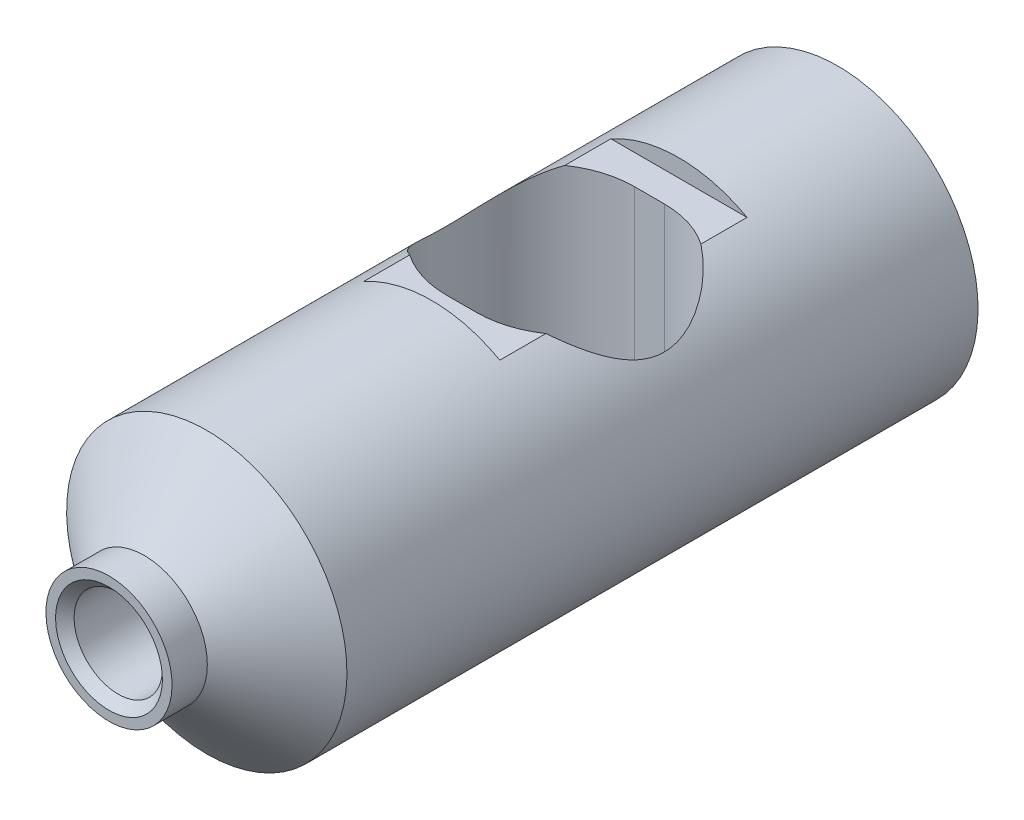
ISO-10303-21;
HEADER;
FILE_DESCRIPTION(('STEP AP214'),'2;1');
FILE_NAME('part.step','',(''),(''),'','','');
FILE_SCHEMA(('AUTOMOTIVE_DESIGN { 1 0 10303 214 1 1 1 1 }'));
ENDSEC;
DATA;
#1=APPLICATION_CONTEXT('core data for automotive mechanical design processes');
#2=APPLICATION_PROTOCOL_DEFINITION('international standard','automotive_design',2000,#1);
#3=PRODUCT_CONTEXT('',#1,'mechanical');
#4=PRODUCT('Part','Part','',(#3));
#5=PRODUCT_RELATED_PRODUCT_CATEGORY('part','',(#4));
#6=PRODUCT_DEFINITION_FORMATION('','',#4);
#7=PRODUCT_DEFINITION_CONTEXT('part definition',#1,'design');
#8=PRODUCT_DEFINITION('design','',#6,#7);
#9=PRODUCT_DEFINITION_SHAPE('','',#8);
#10=(LENGTH_UNIT() NAMED_UNIT(*) SI_UNIT(.MILLI.,.METRE.));
#11=(NAMED_UNIT(*) PLANE_ANGLE_UNIT() SI_UNIT($,.RADIAN.));
#12=(NAMED_UNIT(*) SI_UNIT($,.STERADIAN.) SOLID_ANGLE_UNIT());
#13=UNCERTAINTY_MEASURE_WITH_UNIT(LENGTH_MEASURE(1.E-05),#10,'distance_accuracy_value','');
#14=(GEOMETRIC_REPRESENTATION_CONTEXT(3) GLOBAL_UNCERTAINTY_ASSIGNED_CONTEXT((#13)) GLOBAL_UNIT_ASSIGNED_CONTEXT((#10,
#11,#12)) REPRESENTATION_CONTEXT('',''));
#15=CARTESIAN_POINT('',(0.,0.,0.));
#16=DIRECTION('',(0.,0.,1.));
#17=DIRECTION('',(1.,0.,0.));
#18=AXIS2_PLACEMENT_3D('',#15,#16,#17);
#19=CARTESIAN_POINT('',(0.,0.,-15.8750000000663));
#20=DIRECTION('',(0.,0.,1.));
#21=DIRECTION('',(0.,1.,0.));
#22=AXIS2_PLACEMENT_3D('',#19,#20,#21);
#23=CONICAL_SURFACE('',#22,2.49999999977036,1.0297442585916);
#24=CARTESIAN_POINT('',(0.,-5.6843418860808E-11,-17.3771515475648));
#25=VERTEX_POINT('',#24);
#26=VERTEX_LOOP('',#25);
#27=FACE_BOUND('',#26,.T.);
#28=CARTESIAN_POINT('',(0.,0.,-15.875));
#29=DIRECTION('',(0.,0.,1.));
#30=DIRECTION('',(0.,1.,0.));
#31=AXIS2_PLACEMENT_3D('',#28,#29,#30);
#32=CIRCLE('',#31,2.5);
#33=CARTESIAN_POINT('',(0.,2.5,-15.875));
#34=VERTEX_POINT('',#33);
#35=EDGE_CURVE('E91',#34,#34,#32,.T.);
#36=ORIENTED_EDGE('',*,*,#35,.T.);
#37=EDGE_LOOP('',(#36));
#38=FACE_BOUND('',#37,.T.);
#39=ADVANCED_FACE('F14',(#27,#38),#23,.F.);
#40=CARTESIAN_POINT('',(0.,0.,0.));
#41=DIRECTION('',(0.,0.,1.));
#42=DIRECTION('',(0.,1.,0.));
#43=AXIS2_PLACEMENT_3D('',#40,#41,#42);
#44=CYLINDRICAL_SURFACE('',#43,2.5);
#45=CARTESIAN_POINT('',(0.,0.,-0.524999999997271));
#46=DIRECTION('',(0.,0.,1.));
#47=DIRECTION('',(0.,1.,0.));
#48=AXIS2_PLACEMENT_3D('',#45,#46,#47);
#49=CIRCLE('',#48,2.50000000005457);
#50=CARTESIAN_POINT('',(0.,2.50000000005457,-0.524999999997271));
#51=VERTEX_POINT('',#50);
#52=EDGE_CURVE('E93',#51,#51,#49,.T.);
#53=ORIENTED_EDGE('',*,*,#52,.T.);
#54=EDGE_LOOP('',(#53));
#55=FACE_BOUND('',#54,.T.);
#56=ORIENTED_EDGE('',*,*,#35,.F.);
#57=EDGE_LOOP('',(#56));
#58=FACE_BOUND('',#57,.T.);
#59=ADVANCED_FACE('F88',(#55,#58),#44,.F.);
#60=CARTESIAN_POINT('',(0.,0.,-7.22130688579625E-11));
#61=DIRECTION('',(0.,0.,1.));
#62=DIRECTION('',(0.,1.,0.));
#63=AXIS2_PLACEMENT_3D('',#60,#61,#62);
#64=CONICAL_SURFACE('',#63,3.02499999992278,0.785398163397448);
#65=CARTESIAN_POINT('',(0.,0.,-1.53696499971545E-11));
#66=DIRECTION('',(0.,0.,1.));
#67=DIRECTION('',(0.,1.,0.));
#68=AXIS2_PLACEMENT_3D('',#65,#66,#67);
#69=CIRCLE('',#68,3.02499999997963);
#70=CARTESIAN_POINT('',(0.,3.02499999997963,-1.53696499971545E-11));
#71=VERTEX_POINT('',#70);
#72=EDGE_CURVE('E17',#71,#71,#69,.F.);
#73=ORIENTED_EDGE('',*,*,#72,.F.);
#74=EDGE_LOOP('',(#73));
#75=FACE_BOUND('',#74,.T.);
#76=ORIENTED_EDGE('',*,*,#52,.F.);
#77=EDGE_LOOP('',(#76));
#78=FACE_BOUND('',#77,.T.);
#79=ADVANCED_FACE('F163',(#75,#78),#64,.F.);
#80=CARTESIAN_POINT('',(0.,0.,0.));
#81=DIRECTION('',(0.,0.,1.));
#82=DIRECTION('',(0.,1.,0.));
#83=AXIS2_PLACEMENT_3D('',#80,#81,#82);
#84=PLANE('',#83);
#85=CARTESIAN_POINT('',(0.,0.,0.));
#86=DIRECTION('',(0.,0.,1.));
#87=DIRECTION('',(0.,1.,0.));
#88=AXIS2_PLACEMENT_3D('',#85,#86,#87);
#89=CIRCLE('',#88,3.5687);
#90=CARTESIAN_POINT('',(0.,3.5687,0.));
#91=VERTEX_POINT('',#90);
#92=EDGE_CURVE('E334',#91,#91,#89,.F.);
#93=ORIENTED_EDGE('',*,*,#92,.F.);
#94=EDGE_LOOP('',(#93));
#95=FACE_BOUND('',#94,.T.);
#96=ORIENTED_EDGE('',*,*,#72,.T.);
#97=EDGE_LOOP('',(#96));
#98=FACE_BOUND('',#97,.T.);
#99=ADVANCED_FACE('F159',(#95,#98),#84,.T.);
#100=CARTESIAN_POINT('',(0.,0.,0.));
#101=DIRECTION('',(0.,0.,1.));
#102=DIRECTION('',(0.,1.,0.));
#103=AXIS2_PLACEMENT_3D('',#100,#101,#102);
#104=CYLINDRICAL_SURFACE('',#103,3.5687);
#105=ORIENTED_EDGE('',*,*,#92,.T.);
#106=EDGE_LOOP('',(#105));
#107=FACE_BOUND('',#106,.T.);
#108=CARTESIAN_POINT('',(0.,0.,-2.00000000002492));
#109=DIRECTION('',(0.,0.,-1.));
#110=DIRECTION('',(0.,-1.,0.));
#111=AXIS2_PLACEMENT_3D('',#108,#109,#110);
#112=CIRCLE('',#111,3.56870000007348);
#113=CARTESIAN_POINT('',(0.,-3.56870000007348,-2.00000000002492));
#114=VERTEX_POINT('',#113);
#115=EDGE_CURVE('E335',#114,#114,#112,.T.);
#116=ORIENTED_EDGE('',*,*,#115,.F.);
#117=EDGE_LOOP('',(#116));
#118=FACE_BOUND('',#117,.T.);
#119=ADVANCED_FACE('F156',(#107,#118),#104,.T.);
#120=CARTESIAN_POINT('',(0.850347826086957,-2.199999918,-25.274999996));
#121=DIRECTION('',(0.,-1.,0.));
#122=DIRECTION('',(1.,0.,0.));
#123=AXIS2_PLACEMENT_3D('',#120,#121,#122);
#124=PLANE('',#123);
#125=DIRECTION('',(-1.,0.,0.));
#126=VECTOR('',#125,1.);
#127=CARTESIAN_POINT('',(0.850347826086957,-2.199999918,-30.596299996));
#128=LINE('',#127,#126);
#129=CARTESIAN_POINT('',(0.850347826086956,-2.199999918,-30.596299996));
#130=VERTEX_POINT('',#129);
#131=CARTESIAN_POINT('',(-0.850347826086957,-2.199999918,-30.596299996));
#132=VERTEX_POINT('',#131);
#133=EDGE_CURVE('E328',#130,#132,#128,.T.);
#134=ORIENTED_EDGE('',*,*,#133,.T.);
#135=CARTESIAN_POINT('',(-0.850347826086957,-2.199999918,-25.274999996));
#136=DIRECTION('',(0.,-1.,0.));
#137=DIRECTION('',(1.,0.,0.));
#138=AXIS2_PLACEMENT_3D('',#135,#136,#137);
#139=CIRCLE('',#138,5.3213);
#140=CARTESIAN_POINT('',(-0.850347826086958,-2.199999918,-19.953699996));
#141=VERTEX_POINT('',#140);
#142=EDGE_CURVE('E332',#132,#141,#139,.F.);
#143=ORIENTED_EDGE('',*,*,#142,.T.);
#144=DIRECTION('',(-1.,0.,0.));
#145=VECTOR('',#144,1.);
#146=CARTESIAN_POINT('',(0.850347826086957,-2.199999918,-19.953699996));
#147=LINE('',#146,#145);
#148=CARTESIAN_POINT('',(0.850347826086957,-2.199999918,-19.953699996));
#149=VERTEX_POINT('',#148);
#150=EDGE_CURVE('E79',#141,#149,#147,.F.);
#151=ORIENTED_EDGE('',*,*,#150,.T.);
#152=CARTESIAN_POINT('',(0.850347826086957,-2.199999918,-25.274999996));
#153=DIRECTION('',(0.,-1.,0.));
#154=DIRECTION('',(1.,0.,0.));
#155=AXIS2_PLACEMENT_3D('',#152,#153,#154);
#156=CIRCLE('',#155,5.3213);
#157=EDGE_CURVE('E82',#149,#130,#156,.F.);
#158=ORIENTED_EDGE('',*,*,#157,.T.);
#159=EDGE_LOOP('',(#134,#143,#151,#158));
#160=FACE_BOUND('',#159,.T.);
#161=ADVANCED_FACE('F152',(#160),#124,.F.);
#162=CARTESIAN_POINT('',(0.850347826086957,7.9375,-19.953699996));
#163=DIRECTION('',(0.,0.,1.));
#164=DIRECTION('',(0.,1.,0.));
#165=AXIS2_PLACEMENT_3D('',#162,#163,#164);
#166=PLANE('',#165);
#167=DIRECTION('',(1.,0.,0.));
#168=VECTOR('',#167,1.);
#169=CARTESIAN_POINT('',(7.9375,6.9375,-19.953699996));
#170=LINE('',#169,#168);
#171=CARTESIAN_POINT('',(-0.850347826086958,6.9375,-19.953699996));
#172=VERTEX_POINT('',#171);
#173=CARTESIAN_POINT('',(0.850347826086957,6.9375,-19.953699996));
#174=VERTEX_POINT('',#173);
#175=EDGE_CURVE('E337',#172,#174,#170,.T.);
#176=ORIENTED_EDGE('',*,*,#175,.T.);
#177=DIRECTION('',(0.,-1.,0.));
#178=VECTOR('',#177,1.);
#179=CARTESIAN_POINT('',(0.850347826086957,7.9375,-19.953699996));
#180=LINE('',#179,#178);
#181=EDGE_CURVE('E325',#174,#149,#180,.T.);
#182=ORIENTED_EDGE('',*,*,#181,.T.);
#183=ORIENTED_EDGE('',*,*,#150,.F.);
#184=DIRECTION('',(0.,-1.,0.));
#185=VECTOR('',#184,1.);
#186=CARTESIAN_POINT('',(-0.850347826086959,7.9375,-19.953699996));
#187=LINE('',#186,#185);
#188=EDGE_CURVE('E330',#141,#172,#187,.F.);
#189=ORIENTED_EDGE('',*,*,#188,.T.);
#190=EDGE_LOOP('',(#176,#182,#183,#189));
#191=FACE_BOUND('',#190,.T.);
#192=ADVANCED_FACE('F148',(#191),#166,.F.);
#193=CARTESIAN_POINT('',(0.850347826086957,7.9375,-30.596299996));
#194=DIRECTION('',(0.,0.,-1.));
#195=DIRECTION('',(0.,-1.,0.));
#196=AXIS2_PLACEMENT_3D('',#193,#194,#195);
#197=PLANE('',#196);
#198=DIRECTION('',(-1.,0.,0.));
#199=VECTOR('',#198,1.);
#200=CARTESIAN_POINT('',(0.850347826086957,6.9375,-30.596299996));
#201=LINE('',#200,#199);
#202=CARTESIAN_POINT('',(-0.850347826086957,6.9375,-30.596299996));
#203=VERTEX_POINT('',#202);
#204=CARTESIAN_POINT('',(0.850347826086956,6.9375,-30.596299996));
#205=VERTEX_POINT('',#204);
#206=EDGE_CURVE('E326',#203,#205,#201,.F.);
#207=ORIENTED_EDGE('',*,*,#206,.F.);
#208=DIRECTION('',(0.,-1.,0.));
#209=VECTOR('',#208,1.);
#210=CARTESIAN_POINT('',(-0.850347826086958,7.9375,-30.596299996));
#211=LINE('',#210,#209);
#212=EDGE_CURVE('E317',#203,#132,#211,.T.);
#213=ORIENTED_EDGE('',*,*,#212,.T.);
#214=ORIENTED_EDGE('',*,*,#133,.F.);
#215=DIRECTION('',(0.,-1.,0.));
#216=VECTOR('',#215,1.);
#217=CARTESIAN_POINT('',(0.850347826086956,7.9375,-30.596299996));
#218=LINE('',#217,#216);
#219=EDGE_CURVE('E322',#130,#205,#218,.F.);
#220=ORIENTED_EDGE('',*,*,#219,.T.);
#221=EDGE_LOOP('',(#207,#213,#214,#220));
#222=FACE_BOUND('',#221,.T.);
#223=ADVANCED_FACE('F143',(#222),#197,.F.);
#224=CARTESIAN_POINT('',(0.850347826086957,7.9375,-25.274999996));
#225=DIRECTION('',(0.,-1.,0.));
#226=DIRECTION('',(1.,0.,0.));
#227=AXIS2_PLACEMENT_3D('',#224,#225,#226);
#228=CYLINDRICAL_SURFACE('',#227,5.3213);
#229=CARTESIAN_POINT('',(3.85681215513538,6.9375,-29.6656042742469));
#230=CARTESIAN_POINT('',(3.99388811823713,6.86131547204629,-29.5717055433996));
#231=CARTESIAN_POINT('',(4.12563560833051,6.7827347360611,-29.4720963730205));
#232=CARTESIAN_POINT('',(4.37823980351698,6.62247798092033,-29.2621372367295));
#233=CARTESIAN_POINT('',(4.49909703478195,6.54080211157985,-29.1517877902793));
#234=CARTESIAN_POINT('',(4.73067532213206,6.37534781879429,-28.9200431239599));
#235=CARTESIAN_POINT('',(4.84130200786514,6.29155745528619,-28.7985623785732));
#236=CARTESIAN_POINT('',(5.05101717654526,6.12446631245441,-28.5457174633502));
#237=CARTESIAN_POINT('',(5.15010711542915,6.04116547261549,-28.4143545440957));
#238=CARTESIAN_POINT('',(5.31798357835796,5.89346053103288,-28.1687859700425));
#239=CARTESIAN_POINT('',(5.38889003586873,5.82857336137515,-28.0563151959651));
#240=CARTESIAN_POINT('',(5.52276878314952,5.70187879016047,-27.8250159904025));
#241=CARTESIAN_POINT('',(5.58573885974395,5.64007225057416,-27.706185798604));
#242=CARTESIAN_POINT('',(5.70310902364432,5.52135859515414,-27.4625014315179));
#243=CARTESIAN_POINT('',(5.75753435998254,5.46443727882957,-27.3376664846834));
#244=CARTESIAN_POINT('',(5.85742598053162,5.35722254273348,-27.081737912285));
#245=CARTESIAN_POINT('',(5.90289246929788,5.30692897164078,-26.9506444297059));
#246=CARTESIAN_POINT('',(6.00115110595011,5.19593033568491,-26.6259059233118));
#247=CARTESIAN_POINT('',(6.04901559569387,5.13970787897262,-26.429089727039));
#248=CARTESIAN_POINT('',(6.10396659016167,5.07408120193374,-26.1271718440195));
#249=CARTESIAN_POINT('',(6.11946808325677,5.05533392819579,-26.0255332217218));
#250=CARTESIAN_POINT('',(6.14461588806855,5.02473895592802,-25.8205231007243));
#251=CARTESIAN_POINT('',(6.15426586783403,5.01288693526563,-25.7171527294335));
#252=CARTESIAN_POINT('',(6.16446272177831,5.00033337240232,-25.5571247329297));
#253=CARTESIAN_POINT('',(6.16715478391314,4.99701083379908,-25.5007904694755));
#254=CARTESIAN_POINT('',(6.17074788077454,4.9925728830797,-25.3879745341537));
#255=CARTESIAN_POINT('',(6.17164876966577,4.99145765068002,-25.3314928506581));
#256=CARTESIAN_POINT('',(6.17164581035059,4.99146389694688,-25.1543161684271));
#257=CARTESIAN_POINT('',(6.16752815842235,4.99656675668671,-25.0335813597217));
#258=CARTESIAN_POINT('',(6.15118171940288,5.01667507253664,-24.7934326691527));
#259=CARTESIAN_POINT('',(6.13894586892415,5.03168915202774,-24.6740200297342));
#260=CARTESIAN_POINT('',(6.10666567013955,5.07081662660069,-24.4373403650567));
#261=CARTESIAN_POINT('',(6.08659336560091,5.09496258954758,-24.3200826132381));
#262=CARTESIAN_POINT('',(6.03912597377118,5.15113693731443,-24.0889325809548));
#263=CARTESIAN_POINT('',(6.01172539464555,5.18317123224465,-23.9750428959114));
#264=CARTESIAN_POINT('',(5.94379686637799,5.26102346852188,-23.7281982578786));
#265=CARTESIAN_POINT('',(5.90172826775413,5.30832116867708,-23.5961365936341));
#266=CARTESIAN_POINT('',(5.80854579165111,5.41012584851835,-23.3381650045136));
#267=CARTESIAN_POINT('',(5.75743030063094,5.46463411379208,-23.2122561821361));
#268=CARTESIAN_POINT('',(5.64666822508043,5.57901391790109,-22.9663701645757));
#269=CARTESIAN_POINT('',(5.58700053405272,5.63889858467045,-22.8464086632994));
#270=CARTESIAN_POINT('',(5.45969756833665,5.76224548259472,-22.6127001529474));
#271=CARTESIAN_POINT('',(5.3920600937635,5.82570869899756,-22.498954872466));
#272=CARTESIAN_POINT('',(5.22442189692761,5.97713140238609,-22.2393524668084));
#273=CARTESIAN_POINT('',(5.12132014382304,6.06596989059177,-22.0959997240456));
#274=CARTESIAN_POINT('',(4.90179417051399,6.24470858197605,-21.8205786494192));
#275=CARTESIAN_POINT('',(4.78536680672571,6.33460903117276,-21.6885129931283));
#276=CARTESIAN_POINT('',(4.54072611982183,6.51216560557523,-21.4373201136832));
#277=CARTESIAN_POINT('',(4.4126419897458,6.59983517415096,-21.3180769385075));
#278=CARTESIAN_POINT('',(4.14400879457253,6.7717523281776,-21.091848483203));
#279=CARTESIAN_POINT('',(4.00346109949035,6.85600028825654,-20.9848618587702));
#280=CARTESIAN_POINT('',(3.8568121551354,6.9375,-20.8843957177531));
#281=B_SPLINE_CURVE_WITH_KNOTS('',3,(#229,#230,#231,#232,#233,#234,#235,#236,#237,#238,#239,
#240,#241,#242,#243,#244,#245,#246,#247,#248,#249,#250,#251,#252,#253,#254,#255,#256,#257,#258,
#259,#260,#261,#262,#263,#264,#265,#266,#267,#268,#269,#270,#271,#272,#273,#274,#275,#276,#277,
#278,#279,#280),.UNSPECIFIED.,.F.,.F.,(4,2,2,2,2,2,2,2,2,2,2,2,2,2,2,2,2,2,2,2,2,2,2,2,2,4),(0.,
0.548086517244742,1.09614653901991,1.64884172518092,2.20146708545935,2.64495744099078,
3.08857119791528,3.53084838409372,3.97311547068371,4.60090740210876,4.9141102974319,
5.22711665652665,5.39654189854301,5.56598093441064,5.92794797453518,6.29023036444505,
6.65381716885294,7.01767721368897,7.45633162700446,7.89506435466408,8.33489912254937,
8.77485558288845,9.36701762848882,9.95931965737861,10.5457116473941,11.1320392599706),.UNSPECIFIED.);
#282=CARTESIAN_POINT('',(3.85681215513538,6.9375,-29.6656042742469));
#283=VERTEX_POINT('',#282);
#284=CARTESIAN_POINT('',(3.85681215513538,6.9375,-20.8843957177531));
#285=VERTEX_POINT('',#284);
#286=EDGE_CURVE('E125',#283,#285,#281,.T.);
#287=ORIENTED_EDGE('',*,*,#286,.F.);
#288=CARTESIAN_POINT('',(0.850347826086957,6.9375,-25.274999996));
#289=DIRECTION('',(0.,-1.,0.));
#290=DIRECTION('',(1.,0.,0.));
#291=AXIS2_PLACEMENT_3D('',#288,#289,#290);
#292=CIRCLE('',#291,5.3213);
#293=EDGE_CURVE('E320',#283,#205,#292,.F.);
#294=ORIENTED_EDGE('',*,*,#293,.T.);
#295=ORIENTED_EDGE('',*,*,#219,.F.);
#296=ORIENTED_EDGE('',*,*,#157,.F.);
#297=ORIENTED_EDGE('',*,*,#181,.F.);
#298=CARTESIAN_POINT('',(0.850347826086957,6.9375,-25.274999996));
#299=DIRECTION('',(0.,-1.,0.));
#300=DIRECTION('',(1.,0.,0.));
#301=AXIS2_PLACEMENT_3D('',#298,#299,#300);
#302=CIRCLE('',#301,5.3213);
#303=EDGE_CURVE('E340',#174,#285,#302,.F.);
#304=ORIENTED_EDGE('',*,*,#303,.T.);
#305=EDGE_LOOP('',(#287,#294,#295,#296,#297,#304));
#306=FACE_BOUND('',#305,.T.);
#307=ADVANCED_FACE('F137',(#306),#228,.F.);
#308=CARTESIAN_POINT('',(0.,0.,-5.53778448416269));
#309=DIRECTION('',(0.,0.,-1.));
#310=DIRECTION('',(0.,-1.,0.));
#311=AXIS2_PLACEMENT_3D('',#308,#309,#310);
#312=CONICAL_SURFACE('',#311,7.93749999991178,0.890117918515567);
#313=CARTESIAN_POINT('',(0.,0.,-5.53778448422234));
#314=DIRECTION('',(0.,0.,-1.));
#315=DIRECTION('',(0.,-1.,0.));
#316=AXIS2_PLACEMENT_3D('',#313,#314,#315);
#317=CIRCLE('',#316,7.9375);
#318=CARTESIAN_POINT('',(0.,-7.9375,-5.53778448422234));
#319=VERTEX_POINT('',#318);
#320=EDGE_CURVE('E308',#319,#319,#317,.T.);
#321=ORIENTED_EDGE('',*,*,#320,.F.);
#322=EDGE_LOOP('',(#321));
#323=FACE_BOUND('',#322,.T.);
#324=ORIENTED_EDGE('',*,*,#115,.T.);
#325=EDGE_LOOP('',(#324));
#326=FACE_BOUND('',#325,.T.);
#327=ADVANCED_FACE('F142',(#323,#326),#312,.T.);
#328=CARTESIAN_POINT('',(7.9375,7.9375,-18.274999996));
#329=DIRECTION('',(0.,0.,1.));
#330=DIRECTION('',(0.,1.,0.));
#331=AXIS2_PLACEMENT_3D('',#328,#329,#330);
#332=PLANE('',#331);
#333=DIRECTION('',(1.,0.,0.));
#334=VECTOR('',#333,1.);
#335=CARTESIAN_POINT('',(7.9375,6.9375,-18.274999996));
#336=LINE('',#335,#334);
#337=CARTESIAN_POINT('',(3.85681215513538,6.9375,-18.274999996));
#338=VERTEX_POINT('',#337);
#339=CARTESIAN_POINT('',(-3.85681215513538,6.9375,-18.274999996));
#340=VERTEX_POINT('',#339);
#341=EDGE_CURVE('E315',#338,#340,#336,.F.);
#342=ORIENTED_EDGE('',*,*,#341,.T.);
#343=CARTESIAN_POINT('',(0.,0.,-18.274999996));
#344=DIRECTION('',(0.,0.,-1.));
#345=DIRECTION('',(0.,-1.,0.));
#346=AXIS2_PLACEMENT_3D('',#343,#344,#345);
#347=CIRCLE('',#346,7.9375);
#348=EDGE_CURVE('E111',#338,#340,#347,.F.);
#349=ORIENTED_EDGE('',*,*,#348,.F.);
#350=EDGE_LOOP('',(#342,#349));
#351=FACE_BOUND('',#350,.T.);
#352=ADVANCED_FACE('F212',(#351),#332,.F.);
#353=CARTESIAN_POINT('',(7.9375,6.9375,-32.274999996));
#354=DIRECTION('',(0.,-1.,0.));
#355=DIRECTION('',(1.,0.,0.));
#356=AXIS2_PLACEMENT_3D('',#353,#354,#355);
#357=PLANE('',#356);
#358=DIRECTION('',(0.,0.,-1.));
#359=VECTOR('',#358,1.);
#360=CARTESIAN_POINT('',(3.85681215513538,6.9375,0.));
#361=LINE('',#360,#359);
#362=EDGE_CURVE('E133',#285,#338,#361,.F.);
#363=ORIENTED_EDGE('',*,*,#362,.F.);
#364=ORIENTED_EDGE('',*,*,#303,.F.);
#365=ORIENTED_EDGE('',*,*,#175,.F.);
#366=CARTESIAN_POINT('',(-0.850347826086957,6.9375,-25.274999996));
#367=DIRECTION('',(0.,-1.,0.));
#368=DIRECTION('',(1.,0.,0.));
#369=AXIS2_PLACEMENT_3D('',#366,#367,#368);
#370=CIRCLE('',#369,5.3213);
#371=CARTESIAN_POINT('',(-3.85681215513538,6.9375,-20.8843957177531));
#372=VERTEX_POINT('',#371);
#373=EDGE_CURVE('E321',#172,#372,#370,.T.);
#374=ORIENTED_EDGE('',*,*,#373,.T.);
#375=DIRECTION('',(0.,0.,-1.));
#376=VECTOR('',#375,1.);
#377=CARTESIAN_POINT('',(-3.85681215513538,6.9375,0.));
#378=LINE('',#377,#376);
#379=EDGE_CURVE('E110',#340,#372,#378,.T.);
#380=ORIENTED_EDGE('',*,*,#379,.F.);
#381=ORIENTED_EDGE('',*,*,#341,.F.);
#382=EDGE_LOOP('',(#363,#364,#365,#374,#380,#381));
#383=FACE_BOUND('',#382,.T.);
#384=ADVANCED_FACE('F219',(#383),#357,.F.);
#385=CARTESIAN_POINT('',(-0.850347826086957,7.9375,-25.274999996));
#386=DIRECTION('',(0.,-1.,0.));
#387=DIRECTION('',(1.,0.,0.));
#388=AXIS2_PLACEMENT_3D('',#385,#386,#387);
#389=CYLINDRICAL_SURFACE('',#388,5.3213);
#390=CARTESIAN_POINT('',(-0.850347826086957,6.9375,-25.274999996));
#391=DIRECTION('',(0.,-1.,0.));
#392=DIRECTION('',(1.,0.,0.));
#393=AXIS2_PLACEMENT_3D('',#390,#391,#392);
#394=CIRCLE('',#393,5.3213);
#395=CARTESIAN_POINT('',(-3.85681215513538,6.9375,-29.6656042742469));
#396=VERTEX_POINT('',#395);
#397=EDGE_CURVE('E135',#203,#396,#394,.F.);
#398=ORIENTED_EDGE('',*,*,#397,.T.);
#399=CARTESIAN_POINT('',(-3.85681215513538,6.9375,-20.8843957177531));
#400=CARTESIAN_POINT('',(-3.99388317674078,6.8613182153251,-20.9782910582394));
#401=CARTESIAN_POINT('',(-4.12562610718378,6.78274040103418,-21.0778964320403));
#402=CARTESIAN_POINT('',(-4.37822175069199,6.62248979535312,-21.2878470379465));
#403=CARTESIAN_POINT('',(-4.49907500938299,6.5408171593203,-21.3981917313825));
#404=CARTESIAN_POINT('',(-4.73065469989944,6.37536324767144,-21.6299346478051));
#405=CARTESIAN_POINT('',(-4.84128594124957,6.29156992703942,-21.751419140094));
#406=CARTESIAN_POINT('',(-5.05100967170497,6.12447262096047,-22.0042725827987));
#407=CARTESIAN_POINT('',(-5.15010358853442,6.04116857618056,-22.1356403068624));
#408=CARTESIAN_POINT('',(-5.3179952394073,5.89345027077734,-22.3812310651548));
#409=CARTESIAN_POINT('',(-5.38891216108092,5.82855311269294,-22.4937198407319));
#410=CARTESIAN_POINT('',(-5.52281176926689,5.70183742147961,-22.7250614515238));
#411=CARTESIAN_POINT('',(-5.58579195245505,5.64001986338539,-22.8439162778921));
#412=CARTESIAN_POINT('',(-5.70315779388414,5.52130795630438,-23.0876079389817));
#413=CARTESIAN_POINT('',(-5.75757170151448,5.46439771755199,-23.2124232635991));
#414=CARTESIAN_POINT('',(-5.85744275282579,5.35720402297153,-23.4683109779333));
#415=CARTESIAN_POINT('',(-5.90290025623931,5.30692030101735,-23.5993831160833));
#416=CARTESIAN_POINT('',(-6.00037201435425,5.1968102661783,-23.9215166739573));
#417=CARTESIAN_POINT('',(-6.04771874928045,5.14122983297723,-24.1155766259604));
#418=CARTESIAN_POINT('',(-6.10239908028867,5.07596573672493,-24.4133724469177));
#419=CARTESIAN_POINT('',(-6.11789979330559,5.05723245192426,-24.5137162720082));
#420=CARTESIAN_POINT('',(-6.14319908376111,5.02647119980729,-24.7161252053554));
#421=CARTESIAN_POINT('',(-6.15300011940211,5.01444034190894,-24.818189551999));
#422=CARTESIAN_POINT('',(-6.16673337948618,4.99754205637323,-25.0240177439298));
#423=CARTESIAN_POINT('',(-6.17062470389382,4.99272455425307,-25.1277884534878));
#424=CARTESIAN_POINT('',(-6.1723173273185,4.99063194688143,-25.3354545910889));
#425=CARTESIAN_POINT('',(-6.17011879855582,4.99335662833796,-25.4393500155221));
#426=CARTESIAN_POINT('',(-6.15968208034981,5.00622512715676,-25.6464268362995));
#427=CARTESIAN_POINT('',(-6.15144053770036,5.01637306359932,-25.7496078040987));
#428=CARTESIAN_POINT('',(-6.12909977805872,5.04364455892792,-25.9544379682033));
#429=CARTESIAN_POINT('',(-6.11499750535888,5.06077175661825,-26.0560863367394));
#430=CARTESIAN_POINT('',(-6.07833474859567,5.1047726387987,-26.274310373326));
#431=CARTESIAN_POINT('',(-6.0547424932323,5.13280978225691,-26.3904783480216));
#432=CARTESIAN_POINT('',(-6.00043459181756,5.1961945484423,-26.6191250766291));
#433=CARTESIAN_POINT('',(-5.96971377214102,5.23154747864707,-26.7316010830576));
#434=CARTESIAN_POINT('',(-5.86749512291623,5.34666977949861,-27.0633139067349));
#435=CARTESIAN_POINT('',(-5.78600937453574,5.43541584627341,-27.2764457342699));
#436=CARTESIAN_POINT('',(-5.62599434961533,5.600124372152,-27.6277865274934));
#437=CARTESIAN_POINT('',(-5.55301957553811,5.67271388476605,-27.7702707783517));
#438=CARTESIAN_POINT('',(-5.39574667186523,5.8225087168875,-28.0464288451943));
#439=CARTESIAN_POINT('',(-5.3114429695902,5.89971629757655,-28.1800982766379));
#440=CARTESIAN_POINT('',(-5.13211332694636,6.05635985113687,-28.4384536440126));
#441=CARTESIAN_POINT('',(-5.037094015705,6.13579442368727,-28.5631450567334));
#442=CARTESIAN_POINT('',(-4.83663679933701,6.2950166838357,-28.8034839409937));
#443=CARTESIAN_POINT('',(-4.73120364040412,6.37480419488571,-28.9191354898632));
#444=CARTESIAN_POINT('',(-4.50434837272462,6.53721545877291,-29.1469101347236));
#445=CARTESIAN_POINT('',(-4.38238086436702,6.61977196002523,-29.2585399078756));
#446=CARTESIAN_POINT('',(-4.12766342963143,6.781525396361,-29.4705618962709));
#447=CARTESIAN_POINT('',(-3.99494218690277,6.86073046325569,-29.5709824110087));
#448=CARTESIAN_POINT('',(-3.85681215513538,6.9375,-29.6656042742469));
#449=B_SPLINE_CURVE_WITH_KNOTS('',3,(#399,#400,#401,#402,#403,#404,#405,#406,#407,#408,#409,
#410,#411,#412,#413,#414,#415,#416,#417,#418,#419,#420,#421,#422,#423,#424,#425,#426,#427,#428,
#429,#430,#431,#432,#433,#434,#435,#436,#437,#438,#439,#440,#441,#442,#443,#444,#445,#446,#447,
#448),.UNSPECIFIED.,.F.,.F.,(4,2,2,2,2,2,2,2,2,2,2,2,2,2,2,2,2,2,2,2,2,2,2,2,4),(0.,
0.548066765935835,1.09610605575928,1.6488208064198,2.2014670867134,2.64502662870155,
3.08872572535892,3.53092949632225,3.97311550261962,4.59242816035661,4.90185123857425,
5.21114076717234,5.52256123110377,5.83397288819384,6.14555747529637,6.45730472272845,
6.822170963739,7.18730284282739,7.9187670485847,8.44552702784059,8.9725470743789,
9.4992428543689,10.0256996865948,10.5794347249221,11.1317385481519),.UNSPECIFIED.);
#450=EDGE_CURVE('E101',#372,#396,#449,.T.);
#451=ORIENTED_EDGE('',*,*,#450,.F.);
#452=ORIENTED_EDGE('',*,*,#373,.F.);
#453=ORIENTED_EDGE('',*,*,#188,.F.);
#454=ORIENTED_EDGE('',*,*,#142,.F.);
#455=ORIENTED_EDGE('',*,*,#212,.F.);
#456=EDGE_LOOP('',(#398,#451,#452,#453,#454,#455));
#457=FACE_BOUND('',#456,.T.);
#458=ADVANCED_FACE('F113',(#457),#389,.F.);
#459=CARTESIAN_POINT('',(7.9375,6.9375,-32.274999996));
#460=DIRECTION('',(0.,-1.,0.));
#461=DIRECTION('',(1.,0.,0.));
#462=AXIS2_PLACEMENT_3D('',#459,#460,#461);
#463=PLANE('',#462);
#464=ORIENTED_EDGE('',*,*,#206,.T.);
#465=ORIENTED_EDGE('',*,*,#293,.F.);
#466=DIRECTION('',(0.,0.,-1.));
#467=VECTOR('',#466,1.);
#468=CARTESIAN_POINT('',(3.85681215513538,6.9375,0.));
#469=LINE('',#468,#467);
#470=CARTESIAN_POINT('',(3.85681215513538,6.9375,-32.274999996));
#471=VERTEX_POINT('',#470);
#472=EDGE_CURVE('E134',#471,#283,#469,.F.);
#473=ORIENTED_EDGE('',*,*,#472,.F.);
#474=DIRECTION('',(-1.,0.,0.));
#475=VECTOR('',#474,1.);
#476=CARTESIAN_POINT('',(7.9375,6.9375,-32.274999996));
#477=LINE('',#476,#475);
#478=CARTESIAN_POINT('',(-3.85681215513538,6.9375,-32.274999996));
#479=VERTEX_POINT('',#478);
#480=EDGE_CURVE('E32',#471,#479,#477,.T.);
#481=ORIENTED_EDGE('',*,*,#480,.T.);
#482=DIRECTION('',(0.,0.,-1.));
#483=VECTOR('',#482,1.);
#484=CARTESIAN_POINT('',(-3.85681215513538,6.9375,0.));
#485=LINE('',#484,#483);
#486=EDGE_CURVE('E100',#396,#479,#485,.T.);
#487=ORIENTED_EDGE('',*,*,#486,.F.);
#488=ORIENTED_EDGE('',*,*,#397,.F.);
#489=EDGE_LOOP('',(#464,#465,#473,#481,#487,#488));
#490=FACE_BOUND('',#489,.T.);
#491=ADVANCED_FACE('F232',(#490),#463,.F.);
#492=CARTESIAN_POINT('',(7.9375,7.9375,-32.274999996));
#493=DIRECTION('',(0.,0.,-1.));
#494=DIRECTION('',(0.,-1.,0.));
#495=AXIS2_PLACEMENT_3D('',#492,#493,#494);
#496=PLANE('',#495);
#497=ORIENTED_EDGE('',*,*,#480,.F.);
#498=CARTESIAN_POINT('',(0.,0.,-32.274999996));
#499=DIRECTION('',(0.,0.,-1.));
#500=DIRECTION('',(0.,-1.,0.));
#501=AXIS2_PLACEMENT_3D('',#498,#499,#500);
#502=CIRCLE('',#501,7.9375);
#503=EDGE_CURVE('E23',#479,#471,#502,.T.);
#504=ORIENTED_EDGE('',*,*,#503,.F.);
#505=EDGE_LOOP('',(#497,#504));
#506=FACE_BOUND('',#505,.T.);
#507=ADVANCED_FACE('F239',(#506),#496,.F.);
#508=CARTESIAN_POINT('',(0.,0.,-41.275));
#509=DIRECTION('',(0.,0.,1.));
#510=DIRECTION('',(0.,1.,0.));
#511=AXIS2_PLACEMENT_3D('',#508,#509,#510);
#512=PLANE('',#511);
#513=CARTESIAN_POINT('',(0.,0.,-41.275));
#514=DIRECTION('',(0.,0.,-1.));
#515=DIRECTION('',(0.,-1.,0.));
#516=AXIS2_PLACEMENT_3D('',#513,#514,#515);
#517=CIRCLE('',#516,7.9375);
#518=CARTESIAN_POINT('',(0.,-7.9375,-41.275));
#519=VERTEX_POINT('',#518);
#520=EDGE_CURVE('E9',#519,#519,#517,.F.);
#521=ORIENTED_EDGE('',*,*,#520,.F.);
#522=EDGE_LOOP('',(#521));
#523=FACE_BOUND('',#522,.T.);
#524=ADVANCED_FACE('F121',(#523),#512,.F.);
#525=CARTESIAN_POINT('',(0.,0.,0.));
#526=DIRECTION('',(0.,0.,-1.));
#527=DIRECTION('',(0.,-1.,0.));
#528=AXIS2_PLACEMENT_3D('',#525,#526,#527);
#529=CYLINDRICAL_SURFACE('',#528,7.9375);
#530=ORIENTED_EDGE('',*,*,#362,.T.);
#531=ORIENTED_EDGE('',*,*,#348,.T.);
#532=ORIENTED_EDGE('',*,*,#379,.T.);
#533=ORIENTED_EDGE('',*,*,#450,.T.);
#534=ORIENTED_EDGE('',*,*,#486,.T.);
#535=ORIENTED_EDGE('',*,*,#503,.T.);
#536=ORIENTED_EDGE('',*,*,#472,.T.);
#537=ORIENTED_EDGE('',*,*,#286,.T.);
#538=EDGE_LOOP('',(#530,#531,#532,#533,#534,#535,#536,#537));
#539=FACE_BOUND('',#538,.T.);
#540=ORIENTED_EDGE('',*,*,#520,.T.);
#541=EDGE_LOOP('',(#540));
#542=FACE_BOUND('',#541,.T.);
#543=ORIENTED_EDGE('',*,*,#320,.T.);
#544=EDGE_LOOP('',(#543));
#545=FACE_BOUND('',#544,.T.);
#546=ADVANCED_FACE('F117',(#539,#542,#545),#529,.T.);
#547=CLOSED_SHELL('',(#39,#59,#79,#99,#119,#161,#192,#223,#307,#327,#352,#384,#458,#491,#507,
#524,#546));
#548=MANIFOLD_SOLID_BREP('B1',#547);
#549=ADVANCED_BREP_SHAPE_REPRESENTATION('',(#18,#548),#14);
#550=SHAPE_DEFINITION_REPRESENTATION(#9,#549);
ENDSEC;
END-ISO-10303-21;
